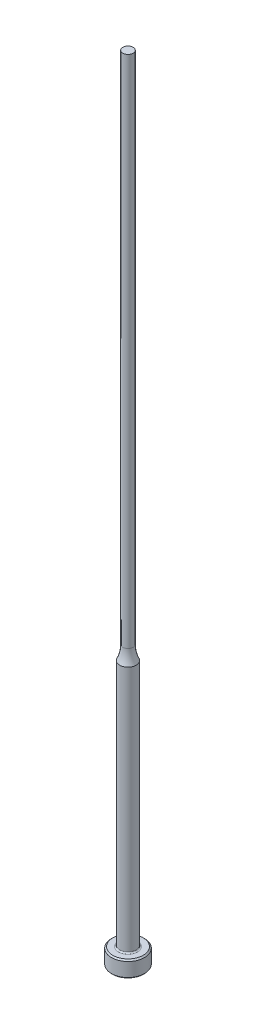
from build123d import *

# Parameters (mm, degrees)
CHAMFER1_SIZE = 0.254
FILLET1_R     = 0.254


with BuildPart() as part:
    # Sketch1 → Revolve1 (revolve)
    with BuildSketch(Plane.XY, mode=Mode.PRIVATE) as revolve1_sk:
        with BuildLine():
            Line((0, 0), (-3.175, 0))
            Line((-3.175, 0), (-3.175, 3.175))
            Line((-3.175, 3.175), (-1.5875, 3.175))
            Line((-1.5875, 3.175), (-1.5875, 50.8))
            ThreePointArc((-1.5875, 50.8), (-1.142565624, 52.109911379), (-0.99187, 53.485093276))
            Line((-0.99187, 53.485093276), (-0.99187, 152.4))
            Line((-0.99187, 152.4), (0, 152.4))
            Line((0, 152.4), (0, 0))
        make_face()
    revolve(revolve1_sk.sketch.rotate(Axis((0, 259.958771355, 0), (0, -1, 0)), 270), axis=Axis((0, 259.958771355, 0), (0, -1, 0)))

    # Chamfer1
    chamfer1_edges = [part.edges().sort_by_distance(p)[0] for p in [
        (0, 0, -3.175),
        (0, 3.175, -3.175),
    ]]
    chamfer(chamfer1_edges, length=CHAMFER1_SIZE)

    # Fillet1
    fillet1_edges = [part.edges().sort_by_distance(p)[0] for p in [
        (0, 3.175, -1.5875),
    ]]
    fillet(fillet1_edges, radius=FILLET1_R)


solid = part.part
